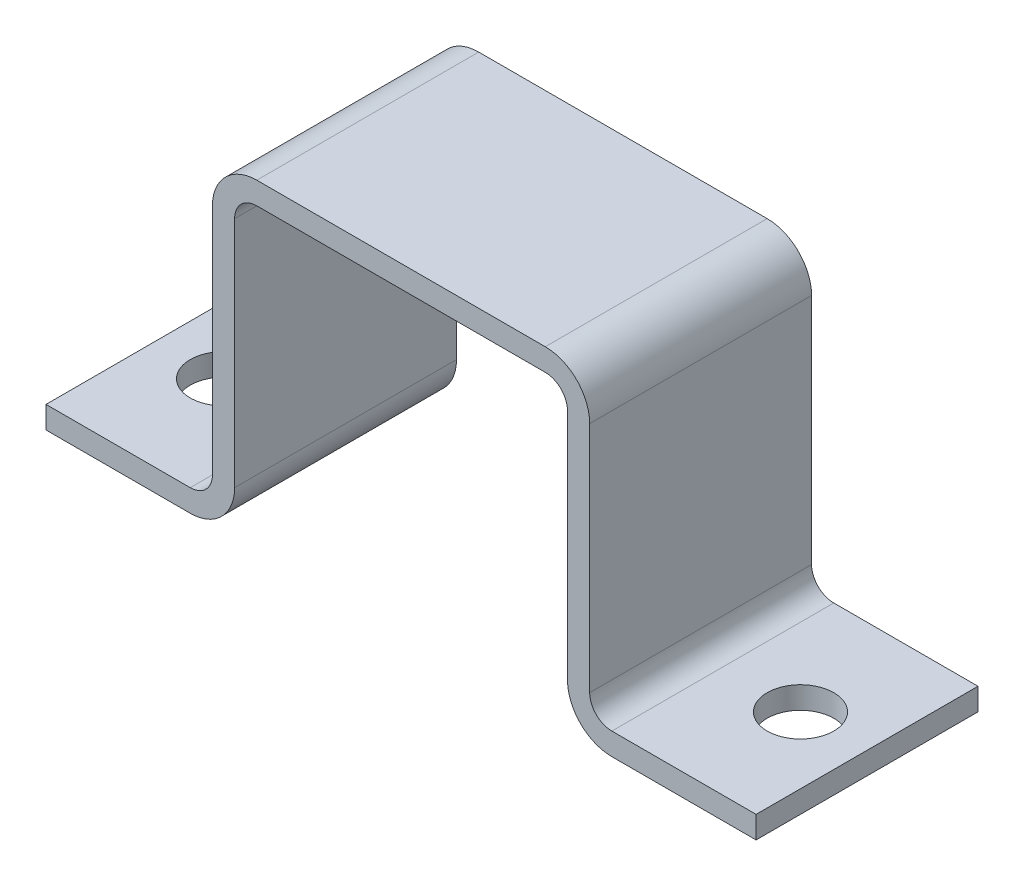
ISO-10303-21;
HEADER;
FILE_DESCRIPTION(('STEP AP214'),'2;1');
FILE_NAME('part.step','',(''),(''),'','','');
FILE_SCHEMA(('AUTOMOTIVE_DESIGN { 1 0 10303 214 1 1 1 1 }'));
ENDSEC;
DATA;
#1=APPLICATION_CONTEXT('core data for automotive mechanical design processes');
#2=APPLICATION_PROTOCOL_DEFINITION('international standard','automotive_design',2000,#1);
#3=PRODUCT_CONTEXT('',#1,'mechanical');
#4=PRODUCT('Part','Part','',(#3));
#5=PRODUCT_RELATED_PRODUCT_CATEGORY('part','',(#4));
#6=PRODUCT_DEFINITION_FORMATION('','',#4);
#7=PRODUCT_DEFINITION_CONTEXT('part definition',#1,'design');
#8=PRODUCT_DEFINITION('design','',#6,#7);
#9=PRODUCT_DEFINITION_SHAPE('','',#8);
#10=(LENGTH_UNIT() NAMED_UNIT(*) SI_UNIT(.MILLI.,.METRE.));
#11=(NAMED_UNIT(*) PLANE_ANGLE_UNIT() SI_UNIT($,.RADIAN.));
#12=(NAMED_UNIT(*) SI_UNIT($,.STERADIAN.) SOLID_ANGLE_UNIT());
#13=UNCERTAINTY_MEASURE_WITH_UNIT(LENGTH_MEASURE(1.E-05),#10,'distance_accuracy_value','');
#14=(GEOMETRIC_REPRESENTATION_CONTEXT(3) GLOBAL_UNCERTAINTY_ASSIGNED_CONTEXT((#13)) GLOBAL_UNIT_ASSIGNED_CONTEXT((#10,
#11,#12)) REPRESENTATION_CONTEXT('',''));
#15=CARTESIAN_POINT('',(0.,0.,0.));
#16=DIRECTION('',(0.,0.,1.));
#17=DIRECTION('',(1.,0.,0.));
#18=AXIS2_PLACEMENT_3D('',#15,#16,#17);
#19=CARTESIAN_POINT('',(0.,2.,20.));
#20=DIRECTION('',(1.,0.,0.));
#21=DIRECTION('',(0.,1.,0.));
#22=AXIS2_PLACEMENT_3D('',#19,#20,#21);
#23=PLANE('',#22);
#24=DIRECTION('',(0.,-1.,0.));
#25=VECTOR('',#24,1.);
#26=CARTESIAN_POINT('',(0.,2.,0.));
#27=LINE('',#26,#25);
#28=CARTESIAN_POINT('',(0.,2.,0.));
#29=VERTEX_POINT('',#28);
#30=CARTESIAN_POINT('',(0.,0.,0.));
#31=VERTEX_POINT('',#30);
#32=EDGE_CURVE('E175',#29,#31,#27,.T.);
#33=ORIENTED_EDGE('',*,*,#32,.T.);
#34=DIRECTION('',(0.,0.,-1.));
#35=VECTOR('',#34,1.);
#36=CARTESIAN_POINT('',(0.,0.,20.));
#37=LINE('',#36,#35);
#38=CARTESIAN_POINT('',(0.,0.,20.));
#39=VERTEX_POINT('',#38);
#40=EDGE_CURVE('E182',#39,#31,#37,.T.);
#41=ORIENTED_EDGE('',*,*,#40,.F.);
#42=DIRECTION('',(0.,-1.,0.));
#43=VECTOR('',#42,1.);
#44=CARTESIAN_POINT('',(0.,2.,20.));
#45=LINE('',#44,#43);
#46=CARTESIAN_POINT('',(0.,2.,20.));
#47=VERTEX_POINT('',#46);
#48=EDGE_CURVE('E225',#47,#39,#45,.T.);
#49=ORIENTED_EDGE('',*,*,#48,.F.);
#50=DIRECTION('',(0.,0.,-1.));
#51=VECTOR('',#50,1.);
#52=CARTESIAN_POINT('',(0.,2.,20.));
#53=LINE('',#52,#51);
#54=EDGE_CURVE('E194',#47,#29,#53,.T.);
#55=ORIENTED_EDGE('',*,*,#54,.T.);
#56=EDGE_LOOP('',(#33,#41,#49,#55));
#57=FACE_BOUND('',#56,.T.);
#58=ADVANCED_FACE('F31',(#57),#23,.F.);
#59=CARTESIAN_POINT('',(0.,0.,20.));
#60=DIRECTION('',(0.,1.,0.));
#61=DIRECTION('',(0.,0.,1.));
#62=AXIS2_PLACEMENT_3D('',#59,#60,#61);
#63=PLANE('',#62);
#64=CARTESIAN_POINT('',(6.,0.,10.));
#65=DIRECTION('',(0.,1.,0.));
#66=DIRECTION('',(-1.,0.,0.));
#67=AXIS2_PLACEMENT_3D('',#64,#65,#66);
#68=CIRCLE('',#67,3.);
#69=CARTESIAN_POINT('',(3.,0.,10.));
#70=VERTEX_POINT('',#69);
#71=EDGE_CURVE('E468',#70,#70,#68,.T.);
#72=ORIENTED_EDGE('',*,*,#71,.T.);
#73=EDGE_LOOP('',(#72));
#74=FACE_BOUND('',#73,.T.);
#75=DIRECTION('',(1.,0.,0.));
#76=VECTOR('',#75,1.);
#77=CARTESIAN_POINT('',(0.,0.,0.));
#78=LINE('',#77,#76);
#79=CARTESIAN_POINT('',(13.,0.,0.));
#80=VERTEX_POINT('',#79);
#81=EDGE_CURVE('E169',#31,#80,#78,.T.);
#82=ORIENTED_EDGE('',*,*,#81,.T.);
#83=DIRECTION('',(0.,0.,-1.));
#84=VECTOR('',#83,1.);
#85=CARTESIAN_POINT('',(13.,0.,20.));
#86=LINE('',#85,#84);
#87=CARTESIAN_POINT('',(13.,0.,20.));
#88=VERTEX_POINT('',#87);
#89=EDGE_CURVE('E307',#80,#88,#86,.F.);
#90=ORIENTED_EDGE('',*,*,#89,.T.);
#91=DIRECTION('',(1.,0.,0.));
#92=VECTOR('',#91,1.);
#93=CARTESIAN_POINT('',(0.,0.,20.));
#94=LINE('',#93,#92);
#95=EDGE_CURVE('E185',#39,#88,#94,.T.);
#96=ORIENTED_EDGE('',*,*,#95,.F.);
#97=ORIENTED_EDGE('',*,*,#40,.T.);
#98=EDGE_LOOP('',(#82,#90,#96,#97));
#99=FACE_BOUND('',#98,.T.);
#100=ADVANCED_FACE('F183',(#74,#99),#63,.F.);
#101=CARTESIAN_POINT('',(17.,0.,20.));
#102=DIRECTION('',(-1.,0.,0.));
#103=DIRECTION('',(0.,-1.,0.));
#104=AXIS2_PLACEMENT_3D('',#101,#102,#103);
#105=PLANE('',#104);
#106=DIRECTION('',(0.,1.,0.));
#107=VECTOR('',#106,1.);
#108=CARTESIAN_POINT('',(17.,0.,20.));
#109=LINE('',#108,#107);
#110=CARTESIAN_POINT('',(17.,4.,20.));
#111=VERTEX_POINT('',#110);
#112=CARTESIAN_POINT('',(17.,25.,20.));
#113=VERTEX_POINT('',#112);
#114=EDGE_CURVE('E228',#111,#113,#109,.T.);
#115=ORIENTED_EDGE('',*,*,#114,.F.);
#116=DIRECTION('',(0.,0.,-1.));
#117=VECTOR('',#116,1.);
#118=CARTESIAN_POINT('',(17.,4.,20.));
#119=LINE('',#118,#117);
#120=CARTESIAN_POINT('',(17.,4.,0.));
#121=VERTEX_POINT('',#120);
#122=EDGE_CURVE('E297',#111,#121,#119,.T.);
#123=ORIENTED_EDGE('',*,*,#122,.T.);
#124=DIRECTION('',(0.,1.,0.));
#125=VECTOR('',#124,1.);
#126=CARTESIAN_POINT('',(17.,0.,0.));
#127=LINE('',#126,#125);
#128=CARTESIAN_POINT('',(17.,25.,0.));
#129=VERTEX_POINT('',#128);
#130=EDGE_CURVE('E179',#121,#129,#127,.T.);
#131=ORIENTED_EDGE('',*,*,#130,.T.);
#132=DIRECTION('',(0.,0.,-1.));
#133=VECTOR('',#132,1.);
#134=CARTESIAN_POINT('',(17.,25.,20.));
#135=LINE('',#134,#133);
#136=EDGE_CURVE('E270',#129,#113,#135,.F.);
#137=ORIENTED_EDGE('',*,*,#136,.T.);
#138=EDGE_LOOP('',(#115,#123,#131,#137));
#139=FACE_BOUND('',#138,.T.);
#140=ADVANCED_FACE('F370',(#139),#105,.F.);
#141=CARTESIAN_POINT('',(17.,27.,20.));
#142=DIRECTION('',(0.,1.,0.));
#143=DIRECTION('',(0.,0.,1.));
#144=AXIS2_PLACEMENT_3D('',#141,#142,#143);
#145=PLANE('',#144);
#146=DIRECTION('',(1.,0.,0.));
#147=VECTOR('',#146,1.);
#148=CARTESIAN_POINT('',(17.,27.,0.));
#149=LINE('',#148,#147);
#150=CARTESIAN_POINT('',(19.,27.,0.));
#151=VERTEX_POINT('',#150);
#152=CARTESIAN_POINT('',(45.,27.,0.));
#153=VERTEX_POINT('',#152);
#154=EDGE_CURVE('E203',#151,#153,#149,.T.);
#155=ORIENTED_EDGE('',*,*,#154,.T.);
#156=DIRECTION('',(0.,0.,-1.));
#157=VECTOR('',#156,1.);
#158=CARTESIAN_POINT('',(45.,27.,20.));
#159=LINE('',#158,#157);
#160=CARTESIAN_POINT('',(45.,27.,20.));
#161=VERTEX_POINT('',#160);
#162=EDGE_CURVE('E268',#153,#161,#159,.F.);
#163=ORIENTED_EDGE('',*,*,#162,.T.);
#164=DIRECTION('',(1.,0.,0.));
#165=VECTOR('',#164,1.);
#166=CARTESIAN_POINT('',(17.,27.,20.));
#167=LINE('',#166,#165);
#168=CARTESIAN_POINT('',(19.,27.,20.));
#169=VERTEX_POINT('',#168);
#170=EDGE_CURVE('E230',#169,#161,#167,.T.);
#171=ORIENTED_EDGE('',*,*,#170,.F.);
#172=DIRECTION('',(0.,0.,-1.));
#173=VECTOR('',#172,1.);
#174=CARTESIAN_POINT('',(19.,27.,0.));
#175=LINE('',#174,#173);
#176=EDGE_CURVE('E265',#169,#151,#175,.T.);
#177=ORIENTED_EDGE('',*,*,#176,.T.);
#178=EDGE_LOOP('',(#155,#163,#171,#177));
#179=FACE_BOUND('',#178,.T.);
#180=ADVANCED_FACE('F375',(#179),#145,.F.);
#181=CARTESIAN_POINT('',(47.,27.,20.));
#182=DIRECTION('',(1.,0.,0.));
#183=DIRECTION('',(0.,1.,0.));
#184=AXIS2_PLACEMENT_3D('',#181,#182,#183);
#185=PLANE('',#184);
#186=DIRECTION('',(0.,-1.,0.));
#187=VECTOR('',#186,1.);
#188=CARTESIAN_POINT('',(47.,27.,0.));
#189=LINE('',#188,#187);
#190=CARTESIAN_POINT('',(47.,25.,0.));
#191=VERTEX_POINT('',#190);
#192=CARTESIAN_POINT('',(47.,4.,0.));
#193=VERTEX_POINT('',#192);
#194=EDGE_CURVE('E206',#191,#193,#189,.T.);
#195=ORIENTED_EDGE('',*,*,#194,.T.);
#196=DIRECTION('',(0.,0.,-1.));
#197=VECTOR('',#196,1.);
#198=CARTESIAN_POINT('',(47.,4.,20.));
#199=LINE('',#198,#197);
#200=CARTESIAN_POINT('',(47.,4.,20.));
#201=VERTEX_POINT('',#200);
#202=EDGE_CURVE('E319',#193,#201,#199,.F.);
#203=ORIENTED_EDGE('',*,*,#202,.T.);
#204=DIRECTION('',(0.,-1.,0.));
#205=VECTOR('',#204,1.);
#206=CARTESIAN_POINT('',(47.,27.,20.));
#207=LINE('',#206,#205);
#208=CARTESIAN_POINT('',(47.,25.,20.));
#209=VERTEX_POINT('',#208);
#210=EDGE_CURVE('E233',#209,#201,#207,.T.);
#211=ORIENTED_EDGE('',*,*,#210,.F.);
#212=DIRECTION('',(0.,0.,-1.));
#213=VECTOR('',#212,1.);
#214=CARTESIAN_POINT('',(47.,25.,0.));
#215=LINE('',#214,#213);
#216=EDGE_CURVE('E262',#209,#191,#215,.T.);
#217=ORIENTED_EDGE('',*,*,#216,.T.);
#218=EDGE_LOOP('',(#195,#203,#211,#217));
#219=FACE_BOUND('',#218,.T.);
#220=ADVANCED_FACE('F382',(#219),#185,.F.);
#221=CARTESIAN_POINT('',(47.,0.,20.));
#222=DIRECTION('',(0.,1.,0.));
#223=DIRECTION('',(-1.,0.,0.));
#224=AXIS2_PLACEMENT_3D('',#221,#222,#223);
#225=PLANE('',#224);
#226=CARTESIAN_POINT('',(58.,0.,10.));
#227=DIRECTION('',(0.,1.,0.));
#228=DIRECTION('',(-1.,0.,0.));
#229=AXIS2_PLACEMENT_3D('',#226,#227,#228);
#230=CIRCLE('',#229,3.);
#231=CARTESIAN_POINT('',(55.,0.,10.));
#232=VERTEX_POINT('',#231);
#233=EDGE_CURVE('E195',#232,#232,#230,.T.);
#234=ORIENTED_EDGE('',*,*,#233,.T.);
#235=EDGE_LOOP('',(#234));
#236=FACE_BOUND('',#235,.T.);
#237=DIRECTION('',(1.,0.,0.));
#238=VECTOR('',#237,1.);
#239=CARTESIAN_POINT('',(47.,0.,20.));
#240=LINE('',#239,#238);
#241=CARTESIAN_POINT('',(51.,0.,20.));
#242=VERTEX_POINT('',#241);
#243=CARTESIAN_POINT('',(64.,0.,20.));
#244=VERTEX_POINT('',#243);
#245=EDGE_CURVE('E236',#242,#244,#240,.T.);
#246=ORIENTED_EDGE('',*,*,#245,.F.);
#247=DIRECTION('',(0.,0.,-1.));
#248=VECTOR('',#247,1.);
#249=CARTESIAN_POINT('',(51.,0.,20.));
#250=LINE('',#249,#248);
#251=CARTESIAN_POINT('',(51.,0.,0.));
#252=VERTEX_POINT('',#251);
#253=EDGE_CURVE('E316',#242,#252,#250,.T.);
#254=ORIENTED_EDGE('',*,*,#253,.T.);
#255=DIRECTION('',(1.,0.,0.));
#256=VECTOR('',#255,1.);
#257=CARTESIAN_POINT('',(47.,0.,0.));
#258=LINE('',#257,#256);
#259=CARTESIAN_POINT('',(64.,0.,0.));
#260=VERTEX_POINT('',#259);
#261=EDGE_CURVE('E209',#252,#260,#258,.T.);
#262=ORIENTED_EDGE('',*,*,#261,.T.);
#263=DIRECTION('',(0.,0.,-1.));
#264=VECTOR('',#263,1.);
#265=CARTESIAN_POINT('',(64.,0.,20.));
#266=LINE('',#265,#264);
#267=EDGE_CURVE('E190',#244,#260,#266,.T.);
#268=ORIENTED_EDGE('',*,*,#267,.F.);
#269=EDGE_LOOP('',(#246,#254,#262,#268));
#270=FACE_BOUND('',#269,.T.);
#271=ADVANCED_FACE('F386',(#236,#270),#225,.F.);
#272=CARTESIAN_POINT('',(64.,0.,20.));
#273=DIRECTION('',(-1.,0.,0.));
#274=DIRECTION('',(0.,0.,1.));
#275=AXIS2_PLACEMENT_3D('',#272,#273,#274);
#276=PLANE('',#275);
#277=DIRECTION('',(0.,1.,0.));
#278=VECTOR('',#277,1.);
#279=CARTESIAN_POINT('',(64.,0.,0.));
#280=LINE('',#279,#278);
#281=CARTESIAN_POINT('',(64.,2.,0.));
#282=VERTEX_POINT('',#281);
#283=EDGE_CURVE('E211',#260,#282,#280,.T.);
#284=ORIENTED_EDGE('',*,*,#283,.T.);
#285=DIRECTION('',(0.,0.,-1.));
#286=VECTOR('',#285,1.);
#287=CARTESIAN_POINT('',(64.,2.,20.));
#288=LINE('',#287,#286);
#289=CARTESIAN_POINT('',(64.,2.,20.));
#290=VERTEX_POINT('',#289);
#291=EDGE_CURVE('E253',#290,#282,#288,.T.);
#292=ORIENTED_EDGE('',*,*,#291,.F.);
#293=DIRECTION('',(0.,1.,0.));
#294=VECTOR('',#293,1.);
#295=CARTESIAN_POINT('',(64.,0.,20.));
#296=LINE('',#295,#294);
#297=EDGE_CURVE('E238',#244,#290,#296,.T.);
#298=ORIENTED_EDGE('',*,*,#297,.F.);
#299=ORIENTED_EDGE('',*,*,#267,.T.);
#300=EDGE_LOOP('',(#284,#292,#298,#299));
#301=FACE_BOUND('',#300,.T.);
#302=ADVANCED_FACE('F390',(#301),#276,.F.);
#303=CARTESIAN_POINT('',(64.,2.,20.));
#304=DIRECTION('',(0.,-1.,0.));
#305=DIRECTION('',(1.,0.,0.));
#306=AXIS2_PLACEMENT_3D('',#303,#304,#305);
#307=PLANE('',#306);
#308=CARTESIAN_POINT('',(58.,2.,10.));
#309=DIRECTION('',(0.,1.,0.));
#310=DIRECTION('',(-1.,0.,0.));
#311=AXIS2_PLACEMENT_3D('',#308,#309,#310);
#312=CIRCLE('',#311,3.);
#313=CARTESIAN_POINT('',(55.,2.,10.));
#314=VERTEX_POINT('',#313);
#315=EDGE_CURVE('E198',#314,#314,#312,.T.);
#316=ORIENTED_EDGE('',*,*,#315,.F.);
#317=EDGE_LOOP('',(#316));
#318=FACE_BOUND('',#317,.T.);
#319=DIRECTION('',(-1.,0.,0.));
#320=VECTOR('',#319,1.);
#321=CARTESIAN_POINT('',(64.,2.,0.));
#322=LINE('',#321,#320);
#323=CARTESIAN_POINT('',(51.,2.,0.));
#324=VERTEX_POINT('',#323);
#325=EDGE_CURVE('E213',#282,#324,#322,.T.);
#326=ORIENTED_EDGE('',*,*,#325,.T.);
#327=DIRECTION('',(0.,0.,-1.));
#328=VECTOR('',#327,1.);
#329=CARTESIAN_POINT('',(51.,2.,20.));
#330=LINE('',#329,#328);
#331=CARTESIAN_POINT('',(51.,2.,20.));
#332=VERTEX_POINT('',#331);
#333=EDGE_CURVE('E260',#324,#332,#330,.F.);
#334=ORIENTED_EDGE('',*,*,#333,.T.);
#335=DIRECTION('',(-1.,0.,0.));
#336=VECTOR('',#335,1.);
#337=CARTESIAN_POINT('',(64.,2.,20.));
#338=LINE('',#337,#336);
#339=EDGE_CURVE('E240',#290,#332,#338,.T.);
#340=ORIENTED_EDGE('',*,*,#339,.F.);
#341=ORIENTED_EDGE('',*,*,#291,.T.);
#342=EDGE_LOOP('',(#326,#334,#340,#341));
#343=FACE_BOUND('',#342,.T.);
#344=ADVANCED_FACE('F394',(#318,#343),#307,.F.);
#345=CARTESIAN_POINT('',(49.,2.,20.));
#346=DIRECTION('',(-1.,0.,0.));
#347=DIRECTION('',(0.,-1.,0.));
#348=AXIS2_PLACEMENT_3D('',#345,#346,#347);
#349=PLANE('',#348);
#350=DIRECTION('',(0.,1.,0.));
#351=VECTOR('',#350,1.);
#352=CARTESIAN_POINT('',(49.,2.,0.));
#353=LINE('',#352,#351);
#354=CARTESIAN_POINT('',(49.,4.,0.));
#355=VERTEX_POINT('',#354);
#356=CARTESIAN_POINT('',(49.,25.,0.));
#357=VERTEX_POINT('',#356);
#358=EDGE_CURVE('E216',#355,#357,#353,.T.);
#359=ORIENTED_EDGE('',*,*,#358,.T.);
#360=DIRECTION('',(0.,0.,-1.));
#361=VECTOR('',#360,1.);
#362=CARTESIAN_POINT('',(49.,25.,20.));
#363=LINE('',#362,#361);
#364=CARTESIAN_POINT('',(49.,25.,20.));
#365=VERTEX_POINT('',#364);
#366=EDGE_CURVE('E38',#357,#365,#363,.F.);
#367=ORIENTED_EDGE('',*,*,#366,.T.);
#368=DIRECTION('',(0.,1.,0.));
#369=VECTOR('',#368,1.);
#370=CARTESIAN_POINT('',(49.,2.,20.));
#371=LINE('',#370,#369);
#372=CARTESIAN_POINT('',(49.,4.,20.));
#373=VERTEX_POINT('',#372);
#374=EDGE_CURVE('E243',#373,#365,#371,.T.);
#375=ORIENTED_EDGE('',*,*,#374,.F.);
#376=DIRECTION('',(0.,0.,-1.));
#377=VECTOR('',#376,1.);
#378=CARTESIAN_POINT('',(49.,4.,0.));
#379=LINE('',#378,#377);
#380=EDGE_CURVE('E189',#373,#355,#379,.T.);
#381=ORIENTED_EDGE('',*,*,#380,.T.);
#382=EDGE_LOOP('',(#359,#367,#375,#381));
#383=FACE_BOUND('',#382,.T.);
#384=ADVANCED_FACE('F327',(#383),#349,.F.);
#385=CARTESIAN_POINT('',(49.,29.,20.));
#386=DIRECTION('',(0.,-1.,0.));
#387=DIRECTION('',(1.,0.,0.));
#388=AXIS2_PLACEMENT_3D('',#385,#386,#387);
#389=PLANE('',#388);
#390=DIRECTION('',(-1.,0.,0.));
#391=VECTOR('',#390,1.);
#392=CARTESIAN_POINT('',(49.,29.,20.));
#393=LINE('',#392,#391);
#394=CARTESIAN_POINT('',(45.,29.,20.));
#395=VERTEX_POINT('',#394);
#396=CARTESIAN_POINT('',(19.,29.,20.));
#397=VERTEX_POINT('',#396);
#398=EDGE_CURVE('E246',#395,#397,#393,.T.);
#399=ORIENTED_EDGE('',*,*,#398,.F.);
#400=DIRECTION('',(0.,0.,-1.));
#401=VECTOR('',#400,1.);
#402=CARTESIAN_POINT('',(45.,29.,20.));
#403=LINE('',#402,#401);
#404=CARTESIAN_POINT('',(45.,29.,0.));
#405=VERTEX_POINT('',#404);
#406=EDGE_CURVE('E322',#395,#405,#403,.T.);
#407=ORIENTED_EDGE('',*,*,#406,.T.);
#408=DIRECTION('',(-1.,0.,0.));
#409=VECTOR('',#408,1.);
#410=CARTESIAN_POINT('',(49.,29.,0.));
#411=LINE('',#410,#409);
#412=CARTESIAN_POINT('',(19.,29.,0.));
#413=VERTEX_POINT('',#412);
#414=EDGE_CURVE('E219',#405,#413,#411,.T.);
#415=ORIENTED_EDGE('',*,*,#414,.T.);
#416=DIRECTION('',(0.,0.,-1.));
#417=VECTOR('',#416,1.);
#418=CARTESIAN_POINT('',(19.,29.,20.));
#419=LINE('',#418,#417);
#420=EDGE_CURVE('E53',#413,#397,#419,.F.);
#421=ORIENTED_EDGE('',*,*,#420,.T.);
#422=EDGE_LOOP('',(#399,#407,#415,#421));
#423=FACE_BOUND('',#422,.T.);
#424=ADVANCED_FACE('F337',(#423),#389,.F.);
#425=CARTESIAN_POINT('',(15.,29.,20.));
#426=DIRECTION('',(1.,0.,0.));
#427=DIRECTION('',(0.,1.,0.));
#428=AXIS2_PLACEMENT_3D('',#425,#426,#427);
#429=PLANE('',#428);
#430=DIRECTION('',(0.,-1.,0.));
#431=VECTOR('',#430,1.);
#432=CARTESIAN_POINT('',(15.,29.,20.));
#433=LINE('',#432,#431);
#434=CARTESIAN_POINT('',(15.,25.,20.));
#435=VERTEX_POINT('',#434);
#436=CARTESIAN_POINT('',(15.,4.,20.));
#437=VERTEX_POINT('',#436);
#438=EDGE_CURVE('E248',#435,#437,#433,.T.);
#439=ORIENTED_EDGE('',*,*,#438,.F.);
#440=DIRECTION('',(0.,0.,-1.));
#441=VECTOR('',#440,1.);
#442=CARTESIAN_POINT('',(15.,25.,20.));
#443=LINE('',#442,#441);
#444=CARTESIAN_POINT('',(15.,25.,0.));
#445=VERTEX_POINT('',#444);
#446=EDGE_CURVE('E11',#435,#445,#443,.T.);
#447=ORIENTED_EDGE('',*,*,#446,.T.);
#448=DIRECTION('',(0.,-1.,0.));
#449=VECTOR('',#448,1.);
#450=CARTESIAN_POINT('',(15.,29.,0.));
#451=LINE('',#450,#449);
#452=CARTESIAN_POINT('',(15.,4.,0.));
#453=VERTEX_POINT('',#452);
#454=EDGE_CURVE('E221',#445,#453,#451,.T.);
#455=ORIENTED_EDGE('',*,*,#454,.T.);
#456=DIRECTION('',(0.,0.,-1.));
#457=VECTOR('',#456,1.);
#458=CARTESIAN_POINT('',(15.,4.,20.));
#459=LINE('',#458,#457);
#460=EDGE_CURVE('E276',#453,#437,#459,.F.);
#461=ORIENTED_EDGE('',*,*,#460,.T.);
#462=EDGE_LOOP('',(#439,#447,#455,#461));
#463=FACE_BOUND('',#462,.T.);
#464=ADVANCED_FACE('F343',(#463),#429,.F.);
#465=CARTESIAN_POINT('',(15.,2.,20.));
#466=DIRECTION('',(0.,-1.,0.));
#467=DIRECTION('',(1.,0.,0.));
#468=AXIS2_PLACEMENT_3D('',#465,#466,#467);
#469=PLANE('',#468);
#470=CARTESIAN_POINT('',(6.,1.99999999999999,10.));
#471=DIRECTION('',(0.,1.,0.));
#472=DIRECTION('',(-1.,0.,0.));
#473=AXIS2_PLACEMENT_3D('',#470,#471,#472);
#474=CIRCLE('',#473,3.);
#475=CARTESIAN_POINT('',(3.,1.99999999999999,10.));
#476=VERTEX_POINT('',#475);
#477=EDGE_CURVE('E471',#476,#476,#474,.T.);
#478=ORIENTED_EDGE('',*,*,#477,.F.);
#479=EDGE_LOOP('',(#478));
#480=FACE_BOUND('',#479,.T.);
#481=DIRECTION('',(-1.,0.,0.));
#482=VECTOR('',#481,1.);
#483=CARTESIAN_POINT('',(15.,2.,20.));
#484=LINE('',#483,#482);
#485=CARTESIAN_POINT('',(13.,2.,20.));
#486=VERTEX_POINT('',#485);
#487=EDGE_CURVE('E250',#486,#47,#484,.T.);
#488=ORIENTED_EDGE('',*,*,#487,.F.);
#489=DIRECTION('',(0.,0.,-1.));
#490=VECTOR('',#489,1.);
#491=CARTESIAN_POINT('',(13.,2.,0.));
#492=LINE('',#491,#490);
#493=CARTESIAN_POINT('',(13.,2.,0.));
#494=VERTEX_POINT('',#493);
#495=EDGE_CURVE('E273',#486,#494,#492,.T.);
#496=ORIENTED_EDGE('',*,*,#495,.T.);
#497=DIRECTION('',(-1.,0.,0.));
#498=VECTOR('',#497,1.);
#499=CARTESIAN_POINT('',(15.,2.,0.));
#500=LINE('',#499,#498);
#501=EDGE_CURVE('E223',#494,#29,#500,.T.);
#502=ORIENTED_EDGE('',*,*,#501,.T.);
#503=ORIENTED_EDGE('',*,*,#54,.F.);
#504=EDGE_LOOP('',(#488,#496,#502,#503));
#505=FACE_BOUND('',#504,.T.);
#506=ADVANCED_FACE('F350',(#480,#505),#469,.F.);
#507=CARTESIAN_POINT('',(0.,27.,20.));
#508=DIRECTION('',(0.,0.,1.));
#509=DIRECTION('',(1.,0.,0.));
#510=AXIS2_PLACEMENT_3D('',#507,#508,#509);
#511=PLANE('',#510);
#512=ORIENTED_EDGE('',*,*,#95,.T.);
#513=CARTESIAN_POINT('',(13.,4.,20.));
#514=DIRECTION('',(0.,0.,1.));
#515=DIRECTION('',(1.,0.,0.));
#516=AXIS2_PLACEMENT_3D('',#513,#514,#515);
#517=CIRCLE('',#516,4.);
#518=EDGE_CURVE('E314',#88,#111,#517,.T.);
#519=ORIENTED_EDGE('',*,*,#518,.T.);
#520=ORIENTED_EDGE('',*,*,#114,.T.);
#521=CARTESIAN_POINT('',(19.,25.,20.));
#522=DIRECTION('',(0.,0.,1.));
#523=DIRECTION('',(1.,0.,0.));
#524=AXIS2_PLACEMENT_3D('',#521,#522,#523);
#525=CIRCLE('',#524,2.);
#526=EDGE_CURVE('E290',#113,#169,#525,.F.);
#527=ORIENTED_EDGE('',*,*,#526,.T.);
#528=ORIENTED_EDGE('',*,*,#170,.T.);
#529=CARTESIAN_POINT('',(45.,25.,20.));
#530=DIRECTION('',(0.,0.,1.));
#531=DIRECTION('',(1.,0.,0.));
#532=AXIS2_PLACEMENT_3D('',#529,#530,#531);
#533=CIRCLE('',#532,2.);
#534=EDGE_CURVE('E285',#161,#209,#533,.F.);
#535=ORIENTED_EDGE('',*,*,#534,.T.);
#536=ORIENTED_EDGE('',*,*,#210,.T.);
#537=CARTESIAN_POINT('',(51.,4.,20.));
#538=DIRECTION('',(0.,0.,1.));
#539=DIRECTION('',(1.,0.,0.));
#540=AXIS2_PLACEMENT_3D('',#537,#538,#539);
#541=CIRCLE('',#540,4.);
#542=EDGE_CURVE('E312',#201,#242,#541,.T.);
#543=ORIENTED_EDGE('',*,*,#542,.T.);
#544=ORIENTED_EDGE('',*,*,#245,.T.);
#545=ORIENTED_EDGE('',*,*,#297,.T.);
#546=ORIENTED_EDGE('',*,*,#339,.T.);
#547=CARTESIAN_POINT('',(51.,4.,20.));
#548=DIRECTION('',(0.,0.,1.));
#549=DIRECTION('',(1.,0.,0.));
#550=AXIS2_PLACEMENT_3D('',#547,#548,#549);
#551=CIRCLE('',#550,2.);
#552=EDGE_CURVE('E281',#332,#373,#551,.F.);
#553=ORIENTED_EDGE('',*,*,#552,.T.);
#554=ORIENTED_EDGE('',*,*,#374,.T.);
#555=CARTESIAN_POINT('',(45.,25.,20.));
#556=DIRECTION('',(0.,0.,1.));
#557=DIRECTION('',(1.,0.,0.));
#558=AXIS2_PLACEMENT_3D('',#555,#556,#557);
#559=CIRCLE('',#558,4.);
#560=EDGE_CURVE('E310',#365,#395,#559,.T.);
#561=ORIENTED_EDGE('',*,*,#560,.T.);
#562=ORIENTED_EDGE('',*,*,#398,.T.);
#563=CARTESIAN_POINT('',(19.,25.,20.));
#564=DIRECTION('',(0.,0.,1.));
#565=DIRECTION('',(1.,0.,0.));
#566=AXIS2_PLACEMENT_3D('',#563,#564,#565);
#567=CIRCLE('',#566,4.);
#568=EDGE_CURVE('E45',#397,#435,#567,.T.);
#569=ORIENTED_EDGE('',*,*,#568,.T.);
#570=ORIENTED_EDGE('',*,*,#438,.T.);
#571=CARTESIAN_POINT('',(13.,4.,20.));
#572=DIRECTION('',(0.,0.,1.));
#573=DIRECTION('',(1.,0.,0.));
#574=AXIS2_PLACEMENT_3D('',#571,#572,#573);
#575=CIRCLE('',#574,2.);
#576=EDGE_CURVE('E295',#437,#486,#575,.F.);
#577=ORIENTED_EDGE('',*,*,#576,.T.);
#578=ORIENTED_EDGE('',*,*,#487,.T.);
#579=ORIENTED_EDGE('',*,*,#48,.T.);
#580=EDGE_LOOP('',(#512,#519,#520,#527,#528,#535,#536,#543,#544,#545,#546,#553,#554,#561,#562,
#569,#570,#577,#578,#579));
#581=FACE_BOUND('',#580,.T.);
#582=ADVANCED_FACE('F332',(#581),#511,.T.);
#583=CARTESIAN_POINT('',(0.,27.,0.));
#584=DIRECTION('',(0.,0.,1.));
#585=DIRECTION('',(1.,0.,0.));
#586=AXIS2_PLACEMENT_3D('',#583,#584,#585);
#587=PLANE('',#586);
#588=ORIENTED_EDGE('',*,*,#130,.F.);
#589=CARTESIAN_POINT('',(13.,4.,0.));
#590=DIRECTION('',(0.,0.,1.));
#591=DIRECTION('',(1.,0.,0.));
#592=AXIS2_PLACEMENT_3D('',#589,#590,#591);
#593=CIRCLE('',#592,4.);
#594=EDGE_CURVE('E176',#121,#80,#593,.F.);
#595=ORIENTED_EDGE('',*,*,#594,.T.);
#596=ORIENTED_EDGE('',*,*,#81,.F.);
#597=ORIENTED_EDGE('',*,*,#32,.F.);
#598=ORIENTED_EDGE('',*,*,#501,.F.);
#599=CARTESIAN_POINT('',(13.,4.,0.));
#600=DIRECTION('',(0.,0.,1.));
#601=DIRECTION('',(1.,0.,0.));
#602=AXIS2_PLACEMENT_3D('',#599,#600,#601);
#603=CIRCLE('',#602,2.);
#604=EDGE_CURVE('E292',#494,#453,#603,.T.);
#605=ORIENTED_EDGE('',*,*,#604,.T.);
#606=ORIENTED_EDGE('',*,*,#454,.F.);
#607=CARTESIAN_POINT('',(19.,25.,0.));
#608=DIRECTION('',(0.,0.,1.));
#609=DIRECTION('',(1.,0.,0.));
#610=AXIS2_PLACEMENT_3D('',#607,#608,#609);
#611=CIRCLE('',#610,4.);
#612=EDGE_CURVE('E300',#445,#413,#611,.F.);
#613=ORIENTED_EDGE('',*,*,#612,.T.);
#614=ORIENTED_EDGE('',*,*,#414,.F.);
#615=CARTESIAN_POINT('',(45.,25.,0.));
#616=DIRECTION('',(0.,0.,1.));
#617=DIRECTION('',(1.,0.,0.));
#618=AXIS2_PLACEMENT_3D('',#615,#616,#617);
#619=CIRCLE('',#618,4.);
#620=EDGE_CURVE('E302',#405,#357,#619,.F.);
#621=ORIENTED_EDGE('',*,*,#620,.T.);
#622=ORIENTED_EDGE('',*,*,#358,.F.);
#623=CARTESIAN_POINT('',(51.,4.,0.));
#624=DIRECTION('',(0.,0.,1.));
#625=DIRECTION('',(1.,0.,0.));
#626=AXIS2_PLACEMENT_3D('',#623,#624,#625);
#627=CIRCLE('',#626,2.);
#628=EDGE_CURVE('E279',#355,#324,#627,.T.);
#629=ORIENTED_EDGE('',*,*,#628,.T.);
#630=ORIENTED_EDGE('',*,*,#325,.F.);
#631=ORIENTED_EDGE('',*,*,#283,.F.);
#632=ORIENTED_EDGE('',*,*,#261,.F.);
#633=CARTESIAN_POINT('',(51.,4.,0.));
#634=DIRECTION('',(0.,0.,1.));
#635=DIRECTION('',(1.,0.,0.));
#636=AXIS2_PLACEMENT_3D('',#633,#634,#635);
#637=CIRCLE('',#636,4.);
#638=EDGE_CURVE('E304',#252,#193,#637,.F.);
#639=ORIENTED_EDGE('',*,*,#638,.T.);
#640=ORIENTED_EDGE('',*,*,#194,.F.);
#641=CARTESIAN_POINT('',(45.,25.,0.));
#642=DIRECTION('',(0.,0.,1.));
#643=DIRECTION('',(1.,0.,0.));
#644=AXIS2_PLACEMENT_3D('',#641,#642,#643);
#645=CIRCLE('',#644,2.);
#646=EDGE_CURVE('E283',#191,#153,#645,.T.);
#647=ORIENTED_EDGE('',*,*,#646,.T.);
#648=ORIENTED_EDGE('',*,*,#154,.F.);
#649=CARTESIAN_POINT('',(19.,25.,0.));
#650=DIRECTION('',(0.,0.,1.));
#651=DIRECTION('',(1.,0.,0.));
#652=AXIS2_PLACEMENT_3D('',#649,#650,#651);
#653=CIRCLE('',#652,2.);
#654=EDGE_CURVE('E287',#151,#129,#653,.T.);
#655=ORIENTED_EDGE('',*,*,#654,.T.);
#656=EDGE_LOOP('',(#588,#595,#596,#597,#598,#605,#606,#613,#614,#621,#622,#629,#630,#631,#632,
#639,#640,#647,#648,#655));
#657=FACE_BOUND('',#656,.T.);
#658=ADVANCED_FACE('F172',(#657),#587,.F.);
#659=CARTESIAN_POINT('',(51.,4.,20.));
#660=DIRECTION('',(0.,0.,1.));
#661=DIRECTION('',(1.,0.,0.));
#662=AXIS2_PLACEMENT_3D('',#659,#660,#661);
#663=CYLINDRICAL_SURFACE('',#662,2.);
#664=ORIENTED_EDGE('',*,*,#552,.F.);
#665=ORIENTED_EDGE('',*,*,#333,.F.);
#666=ORIENTED_EDGE('',*,*,#628,.F.);
#667=ORIENTED_EDGE('',*,*,#380,.F.);
#668=EDGE_LOOP('',(#664,#665,#666,#667));
#669=FACE_BOUND('',#668,.T.);
#670=ADVANCED_FACE('F412',(#669),#663,.F.);
#671=CARTESIAN_POINT('',(45.,25.,20.));
#672=DIRECTION('',(0.,0.,1.));
#673=DIRECTION('',(1.,0.,0.));
#674=AXIS2_PLACEMENT_3D('',#671,#672,#673);
#675=CYLINDRICAL_SURFACE('',#674,2.);
#676=ORIENTED_EDGE('',*,*,#534,.F.);
#677=ORIENTED_EDGE('',*,*,#162,.F.);
#678=ORIENTED_EDGE('',*,*,#646,.F.);
#679=ORIENTED_EDGE('',*,*,#216,.F.);
#680=EDGE_LOOP('',(#676,#677,#678,#679));
#681=FACE_BOUND('',#680,.T.);
#682=ADVANCED_FACE('F363',(#681),#675,.F.);
#683=CARTESIAN_POINT('',(19.,25.,20.));
#684=DIRECTION('',(0.,0.,1.));
#685=DIRECTION('',(1.,0.,0.));
#686=AXIS2_PLACEMENT_3D('',#683,#684,#685);
#687=CYLINDRICAL_SURFACE('',#686,2.);
#688=ORIENTED_EDGE('',*,*,#526,.F.);
#689=ORIENTED_EDGE('',*,*,#136,.F.);
#690=ORIENTED_EDGE('',*,*,#654,.F.);
#691=ORIENTED_EDGE('',*,*,#176,.F.);
#692=EDGE_LOOP('',(#688,#689,#690,#691));
#693=FACE_BOUND('',#692,.T.);
#694=ADVANCED_FACE('F354',(#693),#687,.F.);
#695=CARTESIAN_POINT('',(13.,4.,20.));
#696=DIRECTION('',(0.,0.,1.));
#697=DIRECTION('',(1.,0.,0.));
#698=AXIS2_PLACEMENT_3D('',#695,#696,#697);
#699=CYLINDRICAL_SURFACE('',#698,2.);
#700=ORIENTED_EDGE('',*,*,#576,.F.);
#701=ORIENTED_EDGE('',*,*,#460,.F.);
#702=ORIENTED_EDGE('',*,*,#604,.F.);
#703=ORIENTED_EDGE('',*,*,#495,.F.);
#704=EDGE_LOOP('',(#700,#701,#702,#703));
#705=FACE_BOUND('',#704,.T.);
#706=ADVANCED_FACE('F351',(#705),#699,.F.);
#707=CARTESIAN_POINT('',(13.,4.,20.));
#708=DIRECTION('',(0.,0.,-1.));
#709=DIRECTION('',(-1.,0.,0.));
#710=AXIS2_PLACEMENT_3D('',#707,#708,#709);
#711=CYLINDRICAL_SURFACE('',#710,4.);
#712=ORIENTED_EDGE('',*,*,#518,.F.);
#713=ORIENTED_EDGE('',*,*,#89,.F.);
#714=ORIENTED_EDGE('',*,*,#594,.F.);
#715=ORIENTED_EDGE('',*,*,#122,.F.);
#716=EDGE_LOOP('',(#712,#713,#714,#715));
#717=FACE_BOUND('',#716,.T.);
#718=ADVANCED_FACE('F353',(#717),#711,.T.);
#719=CARTESIAN_POINT('',(51.,4.,20.));
#720=DIRECTION('',(0.,0.,-1.));
#721=DIRECTION('',(-1.,0.,0.));
#722=AXIS2_PLACEMENT_3D('',#719,#720,#721);
#723=CYLINDRICAL_SURFACE('',#722,4.);
#724=ORIENTED_EDGE('',*,*,#542,.F.);
#725=ORIENTED_EDGE('',*,*,#202,.F.);
#726=ORIENTED_EDGE('',*,*,#638,.F.);
#727=ORIENTED_EDGE('',*,*,#253,.F.);
#728=EDGE_LOOP('',(#724,#725,#726,#727));
#729=FACE_BOUND('',#728,.T.);
#730=ADVANCED_FACE('F360',(#729),#723,.T.);
#731=CARTESIAN_POINT('',(45.,25.,20.));
#732=DIRECTION('',(0.,0.,-1.));
#733=DIRECTION('',(-1.,0.,0.));
#734=AXIS2_PLACEMENT_3D('',#731,#732,#733);
#735=CYLINDRICAL_SURFACE('',#734,4.);
#736=ORIENTED_EDGE('',*,*,#560,.F.);
#737=ORIENTED_EDGE('',*,*,#366,.F.);
#738=ORIENTED_EDGE('',*,*,#620,.F.);
#739=ORIENTED_EDGE('',*,*,#406,.F.);
#740=EDGE_LOOP('',(#736,#737,#738,#739));
#741=FACE_BOUND('',#740,.T.);
#742=ADVANCED_FACE('F335',(#741),#735,.T.);
#743=CARTESIAN_POINT('',(19.,25.,20.));
#744=DIRECTION('',(0.,0.,-1.));
#745=DIRECTION('',(-1.,0.,0.));
#746=AXIS2_PLACEMENT_3D('',#743,#744,#745);
#747=CYLINDRICAL_SURFACE('',#746,4.);
#748=ORIENTED_EDGE('',*,*,#568,.F.);
#749=ORIENTED_EDGE('',*,*,#420,.F.);
#750=ORIENTED_EDGE('',*,*,#612,.F.);
#751=ORIENTED_EDGE('',*,*,#446,.F.);
#752=EDGE_LOOP('',(#748,#749,#750,#751));
#753=FACE_BOUND('',#752,.T.);
#754=ADVANCED_FACE('F341',(#753),#747,.T.);
#755=CARTESIAN_POINT('',(58.,0.,10.));
#756=DIRECTION('',(0.,1.,0.));
#757=DIRECTION('',(-1.,0.,0.));
#758=AXIS2_PLACEMENT_3D('',#755,#756,#757);
#759=CYLINDRICAL_SURFACE('',#758,3.);
#760=ORIENTED_EDGE('',*,*,#233,.F.);
#761=EDGE_LOOP('',(#760));
#762=FACE_BOUND('',#761,.T.);
#763=ORIENTED_EDGE('',*,*,#315,.T.);
#764=EDGE_LOOP('',(#763));
#765=FACE_BOUND('',#764,.T.);
#766=ADVANCED_FACE('F457',(#762,#765),#759,.F.);
#767=CARTESIAN_POINT('',(6.,0.,10.));
#768=DIRECTION('',(0.,1.,0.));
#769=DIRECTION('',(-1.,0.,0.));
#770=AXIS2_PLACEMENT_3D('',#767,#768,#769);
#771=CYLINDRICAL_SURFACE('',#770,3.);
#772=ORIENTED_EDGE('',*,*,#71,.F.);
#773=EDGE_LOOP('',(#772));
#774=FACE_BOUND('',#773,.T.);
#775=ORIENTED_EDGE('',*,*,#477,.T.);
#776=EDGE_LOOP('',(#775));
#777=FACE_BOUND('',#776,.T.);
#778=ADVANCED_FACE('F460',(#774,#777),#771,.F.);
#779=CLOSED_SHELL('',(#58,#100,#140,#180,#220,#271,#302,#344,#384,#424,#464,#506,#582,#658,#670,
#682,#694,#706,#718,#730,#742,#754,#766,#778));
#780=MANIFOLD_SOLID_BREP('B2',#779);
#781=ADVANCED_BREP_SHAPE_REPRESENTATION('',(#18,#780),#14);
#782=SHAPE_DEFINITION_REPRESENTATION(#9,#781);
ENDSEC;
END-ISO-10303-21;
